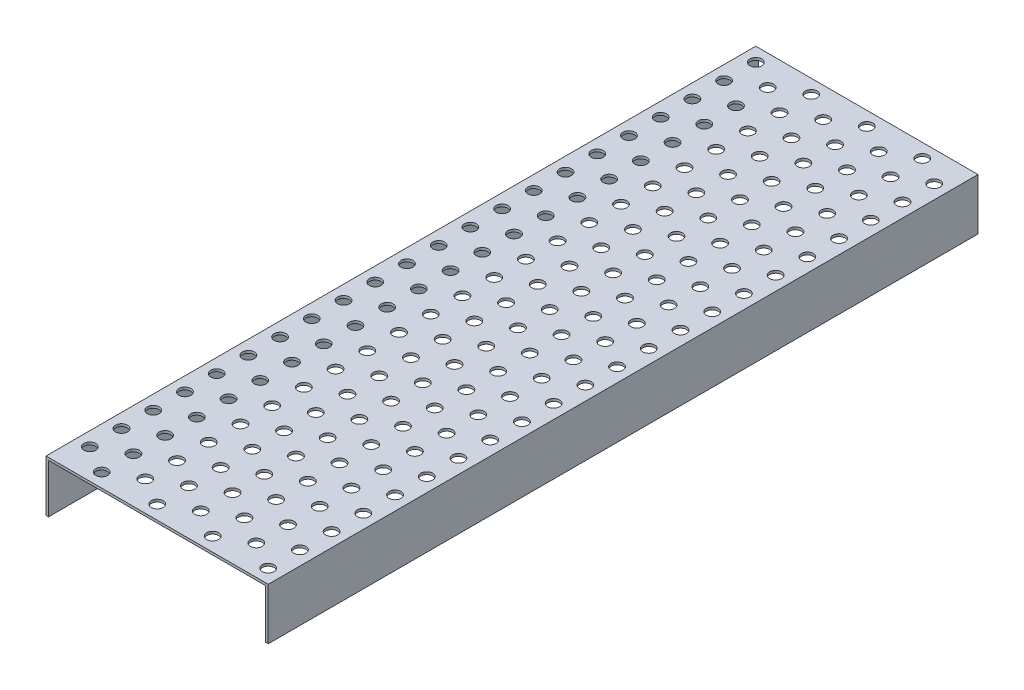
from build123d import *

# Parameters (mm, degrees)
SALIENTE_EXTRUIR1_DEPTH = 568.452
CROQUIS3_R              = 4.7625
CORTAR_EXTRUIR1_DEPTH   = 2


with BuildPart() as part:
    # Croquis2 → Saliente-Extruir1 (new body)
    with BuildSketch(Plane.XY):
        Polygon((0, 0), (0, 41.275), (178, 41.275), (178, 0), (176, 0), (176, 39.275), (2, 39.275), (2, 0), align=None)
    extrude(amount=SALIENTE_EXTRUIR1_DEPTH)

    # Croquis3 → Cortar-Extruir1 (cut)
    with BuildSketch(Plane(origin=(0, 41.275, 0), x_dir=(1, 0, 0), z_dir=(0, 1, 0))):
        with Locations(Location((11.2125, -11.176, 0), (0, 0, 270))):
            Circle(CROQUIS3_R)
        with Locations(Location((55.6625, -11.176, 0), (0, 0, 270))):
            Circle(CROQUIS3_R)
        with Locations(Location((100.1125, -11.176, 0), (0, 0, 270))):
            Circle(CROQUIS3_R)
        with Locations(Location((144.5625, -11.176, 0), (0, 0, 270))):
            Circle(CROQUIS3_R)
        with Locations(Location((11.2125, -36.576, 0), (0, 0, 270))):
            Circle(CROQUIS3_R)
        with Locations(Location((55.6625, -36.576, 0), (0, 0, 270))):
            Circle(CROQUIS3_R)
        with Locations(Location((100.1125, -36.576, 0), (0, 0, 270))):
            Circle(CROQUIS3_R)
        with Locations(Location((144.5625, -36.576, 0), (0, 0, 270))):
            Circle(CROQUIS3_R)
        with Locations(Location((11.2125, -61.976, 0), (0, 0, 270))):
            Circle(CROQUIS3_R)
        with Locations(Location((55.6625, -61.976, 0), (0, 0, 270))):
            Circle(CROQUIS3_R)
        with Locations(Location((100.1125, -61.976, 0), (0, 0, 270))):
            Circle(CROQUIS3_R)
        with Locations(Location((144.5625, -61.976, 0), (0, 0, 270))):
            Circle(CROQUIS3_R)
        with Locations(Location((11.2125, -87.376, 0), (0, 0, 270))):
            Circle(CROQUIS3_R)
        with Locations(Location((55.6625, -87.376, 0), (0, 0, 270))):
            Circle(CROQUIS3_R)
        with Locations(Location((100.1125, -87.376, 0), (0, 0, 270))):
            Circle(CROQUIS3_R)
        with Locations(Location((144.5625, -87.376, 0), (0, 0, 270))):
            Circle(CROQUIS3_R)
        with Locations(Location((11.2125, -112.776, 0), (0, 0, 270))):
            Circle(CROQUIS3_R)
        with Locations(Location((55.6625, -112.776, 0), (0, 0, 270))):
            Circle(CROQUIS3_R)
        with Locations(Location((100.1125, -112.776, 0), (0, 0, 270))):
            Circle(CROQUIS3_R)
        with Locations(Location((144.5625, -112.776, 0), (0, 0, 270))):
            Circle(CROQUIS3_R)
        with Locations(Location((11.2125, -138.176, 0), (0, 0, 270))):
            Circle(CROQUIS3_R)
        with Locations(Location((55.6625, -138.176, 0), (0, 0, 270))):
            Circle(CROQUIS3_R)
        with Locations(Location((100.1125, -138.176, 0), (0, 0, 270))):
            Circle(CROQUIS3_R)
        with Locations(Location((144.5625, -138.176, 0), (0, 0, 270))):
            Circle(CROQUIS3_R)
        with Locations(Location((11.2125, -163.576, 0), (0, 0, 270))):
            Circle(CROQUIS3_R)
        with Locations(Location((55.6625, -163.576, 0), (0, 0, 270))):
            Circle(CROQUIS3_R)
        with Locations(Location((100.1125, -163.576, 0), (0, 0, 270))):
            Circle(CROQUIS3_R)
        with Locations(Location((144.5625, -163.576, 0), (0, 0, 270))):
            Circle(CROQUIS3_R)
        with Locations(Location((11.2125, -188.976, 0), (0, 0, 270))):
            Circle(CROQUIS3_R)
        with Locations(Location((55.6625, -188.976, 0), (0, 0, 270))):
            Circle(CROQUIS3_R)
        with Locations(Location((100.1125, -188.976, 0), (0, 0, 270))):
            Circle(CROQUIS3_R)
        with Locations(Location((144.5625, -188.976, 0), (0, 0, 270))):
            Circle(CROQUIS3_R)
        with Locations(Location((11.2125, -214.376, 0), (0, 0, 270))):
            Circle(CROQUIS3_R)
        with Locations(Location((55.6625, -214.376, 0), (0, 0, 270))):
            Circle(CROQUIS3_R)
        with Locations(Location((100.1125, -214.376, 0), (0, 0, 270))):
            Circle(CROQUIS3_R)
        with Locations(Location((144.5625, -214.376, 0), (0, 0, 270))):
            Circle(CROQUIS3_R)
        with Locations(Location((11.2125, -239.776, 0), (0, 0, 270))):
            Circle(CROQUIS3_R)
        with Locations(Location((55.6625, -239.776, 0), (0, 0, 270))):
            Circle(CROQUIS3_R)
        with Locations(Location((100.1125, -239.776, 0), (0, 0, 270))):
            Circle(CROQUIS3_R)
        with Locations(Location((144.5625, -239.776, 0), (0, 0, 270))):
            Circle(CROQUIS3_R)
        with Locations(Location((11.2125, -265.176, 0), (0, 0, 270))):
            Circle(CROQUIS3_R)
        with Locations(Location((55.6625, -265.176, 0), (0, 0, 270))):
            Circle(CROQUIS3_R)
        with Locations(Location((100.1125, -265.176, 0), (0, 0, 270))):
            Circle(CROQUIS3_R)
        with Locations(Location((144.5625, -265.176, 0), (0, 0, 270))):
            Circle(CROQUIS3_R)
        with Locations(Location((11.2125, -290.576, 0), (0, 0, 270))):
            Circle(CROQUIS3_R)
        with Locations(Location((55.6625, -290.576, 0), (0, 0, 270))):
            Circle(CROQUIS3_R)
        with Locations(Location((100.1125, -290.576, 0), (0, 0, 270))):
            Circle(CROQUIS3_R)
        with Locations(Location((144.5625, -290.576, 0), (0, 0, 270))):
            Circle(CROQUIS3_R)
        with Locations(Location((11.2125, -315.976, 0), (0, 0, 270))):
            Circle(CROQUIS3_R)
        with Locations(Location((55.6625, -315.976, 0), (0, 0, 270))):
            Circle(CROQUIS3_R)
        with Locations(Location((100.1125, -315.976, 0), (0, 0, 270))):
            Circle(CROQUIS3_R)
        with Locations(Location((144.5625, -315.976, 0), (0, 0, 270))):
            Circle(CROQUIS3_R)
        with Locations(Location((11.2125, -341.376, 0), (0, 0, 270))):
            Circle(CROQUIS3_R)
        with Locations(Location((55.6625, -341.376, 0), (0, 0, 270))):
            Circle(CROQUIS3_R)
        with Locations(Location((100.1125, -341.376, 0), (0, 0, 270))):
            Circle(CROQUIS3_R)
        with Locations(Location((144.5625, -341.376, 0), (0, 0, 270))):
            Circle(CROQUIS3_R)
        with Locations(Location((11.2125, -366.776, 0), (0, 0, 270))):
            Circle(CROQUIS3_R)
        with Locations(Location((55.6625, -366.776, 0), (0, 0, 270))):
            Circle(CROQUIS3_R)
        with Locations(Location((100.1125, -366.776, 0), (0, 0, 270))):
            Circle(CROQUIS3_R)
        with Locations(Location((144.5625, -366.776, 0), (0, 0, 270))):
            Circle(CROQUIS3_R)
        with Locations(Location((11.2125, -392.176, 0), (0, 0, 270))):
            Circle(CROQUIS3_R)
        with Locations(Location((55.6625, -392.176, 0), (0, 0, 270))):
            Circle(CROQUIS3_R)
        with Locations(Location((100.1125, -392.176, 0), (0, 0, 270))):
            Circle(CROQUIS3_R)
        with Locations(Location((144.5625, -392.176, 0), (0, 0, 270))):
            Circle(CROQUIS3_R)
        with Locations(Location((11.2125, -417.576, 0), (0, 0, 270))):
            Circle(CROQUIS3_R)
        with Locations(Location((55.6625, -417.576, 0), (0, 0, 270))):
            Circle(CROQUIS3_R)
        with Locations(Location((100.1125, -417.576, 0), (0, 0, 270))):
            Circle(CROQUIS3_R)
        with Locations(Location((144.5625, -417.576, 0), (0, 0, 270))):
            Circle(CROQUIS3_R)
        with Locations(Location((11.2125, -442.976, 0), (0, 0, 270))):
            Circle(CROQUIS3_R)
        with Locations(Location((55.6625, -442.976, 0), (0, 0, 270))):
            Circle(CROQUIS3_R)
        with Locations(Location((100.1125, -442.976, 0), (0, 0, 270))):
            Circle(CROQUIS3_R)
        with Locations(Location((144.5625, -442.976, 0), (0, 0, 270))):
            Circle(CROQUIS3_R)
        with Locations(Location((11.2125, -468.376, 0), (0, 0, 270))):
            Circle(CROQUIS3_R)
        with Locations(Location((55.6625, -468.376, 0), (0, 0, 270))):
            Circle(CROQUIS3_R)
        with Locations(Location((100.1125, -468.376, 0), (0, 0, 270))):
            Circle(CROQUIS3_R)
        with Locations(Location((144.5625, -468.376, 0), (0, 0, 270))):
            Circle(CROQUIS3_R)
        with Locations(Location((11.2125, -493.776, 0), (0, 0, 270))):
            Circle(CROQUIS3_R)
        with Locations(Location((55.6625, -493.776, 0), (0, 0, 270))):
            Circle(CROQUIS3_R)
        with Locations(Location((100.1125, -493.776, 0), (0, 0, 270))):
            Circle(CROQUIS3_R)
        with Locations(Location((144.5625, -493.776, 0), (0, 0, 270))):
            Circle(CROQUIS3_R)
        with Locations(Location((11.2125, -519.176, 0), (0, 0, 270))):
            Circle(CROQUIS3_R)
        with Locations(Location((55.6625, -519.176, 0), (0, 0, 270))):
            Circle(CROQUIS3_R)
        with Locations(Location((100.1125, -519.176, 0), (0, 0, 270))):
            Circle(CROQUIS3_R)
        with Locations(Location((144.5625, -519.176, 0), (0, 0, 270))):
            Circle(CROQUIS3_R)
        with Locations(Location((11.2125, -544.576, 0), (0, 0, 270))):
            Circle(CROQUIS3_R)
        with Locations(Location((55.6625, -544.576, 0), (0, 0, 270))):
            Circle(CROQUIS3_R)
        with Locations(Location((100.1125, -544.576, 0), (0, 0, 270))):
            Circle(CROQUIS3_R)
        with Locations(Location((144.5625, -544.576, 0), (0, 0, 270))):
            Circle(CROQUIS3_R)
        with Locations(Location((33.4375, -23.876, 0), (0, 0, 270))):
            Circle(CROQUIS3_R)
        with Locations(Location((77.8875, -23.876, 0), (0, 0, 270))):
            Circle(CROQUIS3_R)
        with Locations(Location((122.3375, -23.876, 0), (0, 0, 270))):
            Circle(CROQUIS3_R)
        with Locations(Location((166.7875, -23.876, 0), (0, 0, 270))):
            Circle(CROQUIS3_R)
        with Locations(Location((33.4375, -49.276, 0), (0, 0, 270))):
            Circle(CROQUIS3_R)
        with Locations(Location((77.8875, -49.276, 0), (0, 0, 270))):
            Circle(CROQUIS3_R)
        with Locations(Location((122.3375, -49.276, 0), (0, 0, 270))):
            Circle(CROQUIS3_R)
        with Locations(Location((166.7875, -49.276, 0), (0, 0, 270))):
            Circle(CROQUIS3_R)
        with Locations(Location((33.4375, -74.676, 0), (0, 0, 270))):
            Circle(CROQUIS3_R)
        with Locations(Location((77.8875, -74.676, 0), (0, 0, 270))):
            Circle(CROQUIS3_R)
        with Locations(Location((122.3375, -74.676, 0), (0, 0, 270))):
            Circle(CROQUIS3_R)
        with Locations(Location((166.7875, -74.676, 0), (0, 0, 270))):
            Circle(CROQUIS3_R)
        with Locations(Location((33.4375, -100.076, 0), (0, 0, 270))):
            Circle(CROQUIS3_R)
        with Locations(Location((77.8875, -100.076, 0), (0, 0, 270))):
            Circle(CROQUIS3_R)
        with Locations(Location((122.3375, -100.076, 0), (0, 0, 270))):
            Circle(CROQUIS3_R)
        with Locations(Location((166.7875, -100.076, 0), (0, 0, 270))):
            Circle(CROQUIS3_R)
        with Locations(Location((33.4375, -125.476, 0), (0, 0, 270))):
            Circle(CROQUIS3_R)
        with Locations(Location((77.8875, -125.476, 0), (0, 0, 270))):
            Circle(CROQUIS3_R)
        with Locations(Location((122.3375, -125.476, 0), (0, 0, 270))):
            Circle(CROQUIS3_R)
        with Locations(Location((166.7875, -125.476, 0), (0, 0, 270))):
            Circle(CROQUIS3_R)
        with Locations(Location((33.4375, -150.876, 0), (0, 0, 270))):
            Circle(CROQUIS3_R)
        with Locations(Location((77.8875, -150.876, 0), (0, 0, 270))):
            Circle(CROQUIS3_R)
        with Locations(Location((122.3375, -150.876, 0), (0, 0, 270))):
            Circle(CROQUIS3_R)
        with Locations(Location((166.7875, -150.876, 0), (0, 0, 270))):
            Circle(CROQUIS3_R)
        with Locations(Location((33.4375, -176.276, 0), (0, 0, 270))):
            Circle(CROQUIS3_R)
        with Locations(Location((77.8875, -176.276, 0), (0, 0, 270))):
            Circle(CROQUIS3_R)
        with Locations(Location((122.3375, -176.276, 0), (0, 0, 270))):
            Circle(CROQUIS3_R)
        with Locations(Location((166.7875, -176.276, 0), (0, 0, 270))):
            Circle(CROQUIS3_R)
        with Locations(Location((33.4375, -201.676, 0), (0, 0, 270))):
            Circle(CROQUIS3_R)
        with Locations(Location((77.8875, -201.676, 0), (0, 0, 270))):
            Circle(CROQUIS3_R)
        with Locations(Location((122.3375, -201.676, 0), (0, 0, 270))):
            Circle(CROQUIS3_R)
        with Locations(Location((166.7875, -201.676, 0), (0, 0, 270))):
            Circle(CROQUIS3_R)
        with Locations(Location((33.4375, -227.076, 0), (0, 0, 270))):
            Circle(CROQUIS3_R)
        with Locations(Location((77.8875, -227.076, 0), (0, 0, 270))):
            Circle(CROQUIS3_R)
        with Locations(Location((122.3375, -227.076, 0), (0, 0, 270))):
            Circle(CROQUIS3_R)
        with Locations(Location((166.7875, -227.076, 0), (0, 0, 270))):
            Circle(CROQUIS3_R)
        with Locations(Location((33.4375, -252.476, 0), (0, 0, 270))):
            Circle(CROQUIS3_R)
        with Locations(Location((77.8875, -252.476, 0), (0, 0, 270))):
            Circle(CROQUIS3_R)
        with Locations(Location((122.3375, -252.476, 0), (0, 0, 270))):
            Circle(CROQUIS3_R)
        with Locations(Location((166.7875, -252.476, 0), (0, 0, 270))):
            Circle(CROQUIS3_R)
        with Locations(Location((33.4375, -277.876, 0), (0, 0, 270))):
            Circle(CROQUIS3_R)
        with Locations(Location((77.8875, -277.876, 0), (0, 0, 270))):
            Circle(CROQUIS3_R)
        with Locations(Location((122.3375, -277.876, 0), (0, 0, 270))):
            Circle(CROQUIS3_R)
        with Locations(Location((166.7875, -277.876, 0), (0, 0, 270))):
            Circle(CROQUIS3_R)
        with Locations(Location((33.4375, -303.276, 0), (0, 0, 270))):
            Circle(CROQUIS3_R)
        with Locations(Location((77.8875, -303.276, 0), (0, 0, 270))):
            Circle(CROQUIS3_R)
        with Locations(Location((122.3375, -303.276, 0), (0, 0, 270))):
            Circle(CROQUIS3_R)
        with Locations(Location((166.7875, -303.276, 0), (0, 0, 270))):
            Circle(CROQUIS3_R)
        with Locations(Location((33.4375, -328.676, 0), (0, 0, 270))):
            Circle(CROQUIS3_R)
        with Locations(Location((77.8875, -328.676, 0), (0, 0, 270))):
            Circle(CROQUIS3_R)
        with Locations(Location((122.3375, -328.676, 0), (0, 0, 270))):
            Circle(CROQUIS3_R)
        with Locations(Location((166.7875, -328.676, 0), (0, 0, 270))):
            Circle(CROQUIS3_R)
        with Locations(Location((33.4375, -354.076, 0), (0, 0, 270))):
            Circle(CROQUIS3_R)
        with Locations(Location((77.8875, -354.076, 0), (0, 0, 270))):
            Circle(CROQUIS3_R)
        with Locations(Location((122.3375, -354.076, 0), (0, 0, 270))):
            Circle(CROQUIS3_R)
        with Locations(Location((166.7875, -354.076, 0), (0, 0, 270))):
            Circle(CROQUIS3_R)
        with Locations(Location((33.4375, -379.476, 0), (0, 0, 270))):
            Circle(CROQUIS3_R)
        with Locations(Location((77.8875, -379.476, 0), (0, 0, 270))):
            Circle(CROQUIS3_R)
        with Locations(Location((122.3375, -379.476, 0), (0, 0, 270))):
            Circle(CROQUIS3_R)
        with Locations(Location((166.7875, -379.476, 0), (0, 0, 270))):
            Circle(CROQUIS3_R)
        with Locations(Location((33.4375, -404.876, 0), (0, 0, 270))):
            Circle(CROQUIS3_R)
        with Locations(Location((77.8875, -404.876, 0), (0, 0, 270))):
            Circle(CROQUIS3_R)
        with Locations(Location((122.3375, -404.876, 0), (0, 0, 270))):
            Circle(CROQUIS3_R)
        with Locations(Location((166.7875, -404.876, 0), (0, 0, 270))):
            Circle(CROQUIS3_R)
        with Locations(Location((33.4375, -430.276, 0), (0, 0, 270))):
            Circle(CROQUIS3_R)
        with Locations(Location((77.8875, -430.276, 0), (0, 0, 270))):
            Circle(CROQUIS3_R)
        with Locations(Location((122.3375, -430.276, 0), (0, 0, 270))):
            Circle(CROQUIS3_R)
        with Locations(Location((166.7875, -430.276, 0), (0, 0, 270))):
            Circle(CROQUIS3_R)
        with Locations(Location((33.4375, -455.676, 0), (0, 0, 270))):
            Circle(CROQUIS3_R)
        with Locations(Location((77.8875, -455.676, 0), (0, 0, 270))):
            Circle(CROQUIS3_R)
        with Locations(Location((122.3375, -455.676, 0), (0, 0, 270))):
            Circle(CROQUIS3_R)
        with Locations(Location((166.7875, -455.676, 0), (0, 0, 270))):
            Circle(CROQUIS3_R)
        with Locations(Location((33.4375, -481.076, 0), (0, 0, 270))):
            Circle(CROQUIS3_R)
        with Locations(Location((77.8875, -481.076, 0), (0, 0, 270))):
            Circle(CROQUIS3_R)
        with Locations(Location((122.3375, -481.076, 0), (0, 0, 270))):
            Circle(CROQUIS3_R)
        with Locations(Location((166.7875, -481.076, 0), (0, 0, 270))):
            Circle(CROQUIS3_R)
        with Locations(Location((33.4375, -506.476, 0), (0, 0, 270))):
            Circle(CROQUIS3_R)
        with Locations(Location((77.8875, -506.476, 0), (0, 0, 270))):
            Circle(CROQUIS3_R)
        with Locations(Location((122.3375, -506.476, 0), (0, 0, 270))):
            Circle(CROQUIS3_R)
        with Locations(Location((166.7875, -506.476, 0), (0, 0, 270))):
            Circle(CROQUIS3_R)
        with Locations(Location((33.4375, -531.876, 0), (0, 0, 270))):
            Circle(CROQUIS3_R)
        with Locations(Location((77.8875, -531.876, 0), (0, 0, 270))):
            Circle(CROQUIS3_R)
        with Locations(Location((122.3375, -531.876, 0), (0, 0, 270))):
            Circle(CROQUIS3_R)
        with Locations(Location((166.7875, -531.876, 0), (0, 0, 270))):
            Circle(CROQUIS3_R)
        with Locations(Location((33.4375, -557.276, 0), (0, 0, 270))):
            Circle(CROQUIS3_R)
        with Locations(Location((77.8875, -557.276, 0), (0, 0, 270))):
            Circle(CROQUIS3_R)
        with Locations(Location((122.3375, -557.276, 0), (0, 0, 270))):
            Circle(CROQUIS3_R)
        with Locations(Location((166.7875, -557.276, 0), (0, 0, 270))):
            Circle(CROQUIS3_R)
    extrude(amount=-CORTAR_EXTRUIR1_DEPTH, mode=Mode.SUBTRACT)


solid = part.part
